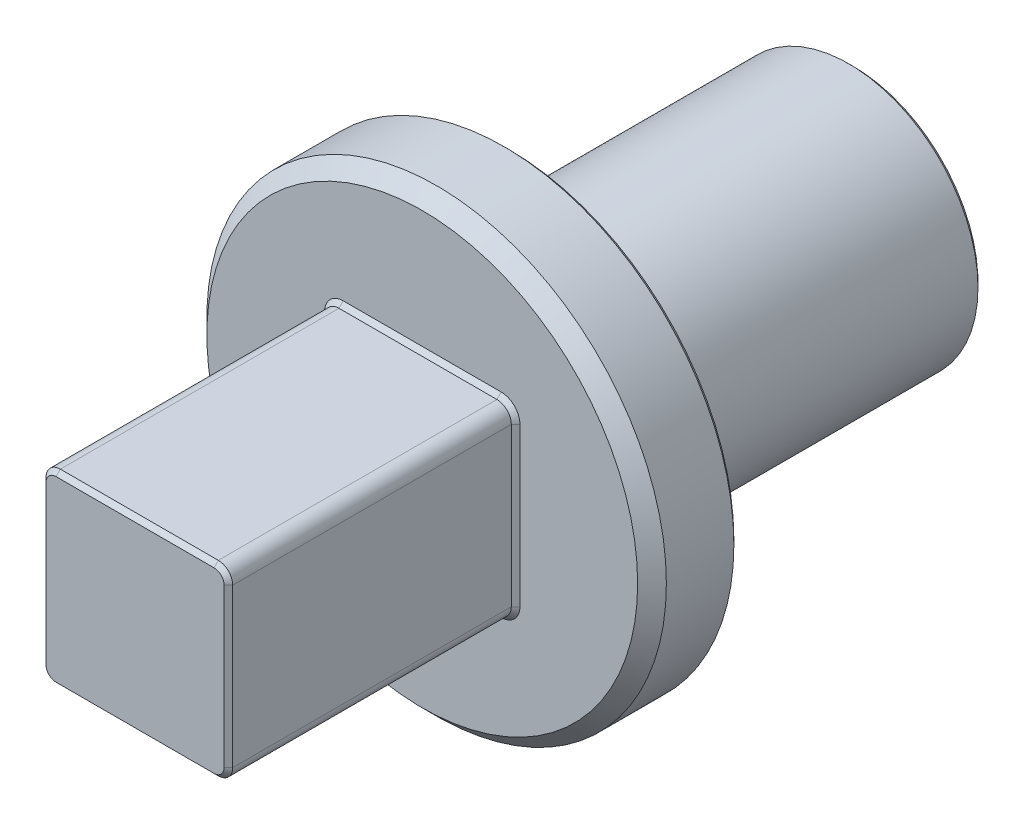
from build123d import *

# Parameters (mm, degrees)
SKETCH_1_R      = 8
EXTRUDE_1_DEPTH = 3
SKETCH_2_W      = 6.5
SKETCH_2_H      = 6.5
EXTRUDE_2_DEPTH = 10
SKETCH_3_R      = 4.5
EXTRUDE_3_DEPTH = 12
CHAMFER_1_SIZE  = 0.5
FILLET_1_R      = 0.5
CHAMFER_2_SIZE  = 0.15


with BuildPart() as part:
    # Sketch 1 → Extrude 1 (new body)
    with BuildSketch(Plane.XY):
        Circle(SKETCH_1_R)
    extrude(amount=EXTRUDE_1_DEPTH)

    # Sketch 2 → Extrude 2 (add)
    with BuildSketch(Plane.XY.offset(3)):
        Rectangle(SKETCH_2_W, SKETCH_2_H)
    extrude(amount=EXTRUDE_2_DEPTH)

    # Sketch 3 → Extrude 3 (add)
    with BuildSketch(Plane(origin=(0, 0, 0), x_dir=(-1, 0, 0), z_dir=(0, 0, -1))):
        with Locations(Location((0, 0, 0), (0, 0, 180))):
            Circle(SKETCH_3_R)
    extrude(amount=EXTRUDE_3_DEPTH)

    # Chamfer 1
    chamfer_1_edges = [part.edges().sort_by_distance(p)[0] for p in [
        (-8, 0, 3),
    ]]
    chamfer(chamfer_1_edges, length=CHAMFER_1_SIZE)

    # Fillet 1
    fillet_1_edges = [part.edges().sort_by_distance(p)[0] for p in [
        (-3.25, 3.25, 8),
        (-3.25, -3.25, 8),
        (3.25, -3.25, 8),
        (3.25, 3.25, 8),
    ]]
    fillet(fillet_1_edges, radius=FILLET_1_R)

    # Chamfer 2
    chamfer_2_edges = [part.edges().sort_by_distance(p)[0] for p in [
        (-4.5, 0, 0),
        (-8, 0, 0),
        (-4.5, 0, -12),
        (0, -3.25, 3),
        (0, -3.25, 13),
        (-3.25, 0, 3),
        (-3.25, 0, 13),
        (3.25, 0, 13),
        (0, 3.25, 13),
        (3.103553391, 3.103553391, 13),
        (-3.103553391, 3.103553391, 13),
        (3.103553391, -3.103553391, 13),
        (-3.103553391, -3.103553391, 13),
        (3.25, 0, 3),
        (0, 3.25, 3),
        (-3.103553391, -3.103553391, 3),
        (3.103553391, -3.103553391, 3),
        (-3.103553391, 3.103553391, 3),
        (3.103553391, 3.103553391, 3),
    ]]
    chamfer(chamfer_2_edges, length=CHAMFER_2_SIZE)


solid = part.part
